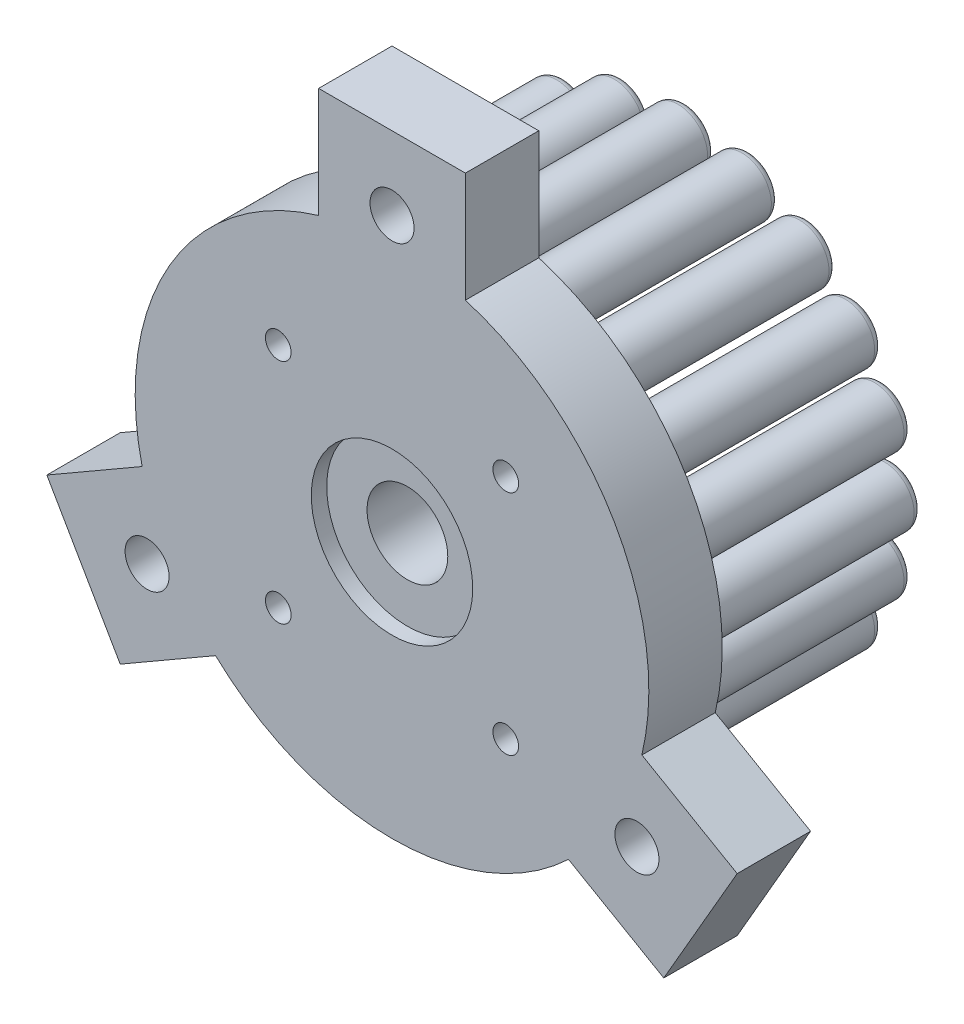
from build123d import *

# Parameters (mm, degrees)
SKIZZE1_R                          = 4
AUFSATZ_LINEAR_AUSTRAGEN1_DEPTH    = 30
AUFSATZ_LINEAR_AUSTRAGEN1_2_DEPTH  = 30
AUFSATZ_LINEAR_AUSTRAGEN1_3_DEPTH  = 30
AUFSATZ_LINEAR_AUSTRAGEN1_4_DEPTH  = 30
AUFSATZ_LINEAR_AUSTRAGEN1_5_DEPTH  = 30
AUFSATZ_LINEAR_AUSTRAGEN1_6_DEPTH  = 30
AUFSATZ_LINEAR_AUSTRAGEN1_7_DEPTH  = 30
AUFSATZ_LINEAR_AUSTRAGEN1_8_DEPTH  = 30
AUFSATZ_LINEAR_AUSTRAGEN1_9_DEPTH  = 30
AUFSATZ_LINEAR_AUSTRAGEN1_10_DEPTH = 30
AUFSATZ_LINEAR_AUSTRAGEN1_11_DEPTH = 30
AUFSATZ_LINEAR_AUSTRAGEN1_12_DEPTH = 30
AUFSATZ_LINEAR_AUSTRAGEN1_13_DEPTH = 30
AUFSATZ_LINEAR_AUSTRAGEN1_14_DEPTH = 30
AUFSATZ_LINEAR_AUSTRAGEN1_15_DEPTH = 30
AUFSATZ_LINEAR_AUSTRAGEN1_16_DEPTH = 30
AUFSATZ_LINEAR_AUSTRAGEN1_17_DEPTH = 30
AUFSATZ_LINEAR_AUSTRAGEN1_18_DEPTH = 30
AUFSATZ_LINEAR_AUSTRAGEN1_19_DEPTH = 30
AUFSATZ_LINEAR_AUSTRAGEN1_20_DEPTH = 30
SKIZZE5_R                          = 35
AUFSATZ_LINEAR_AUSTRAGEN2_DEPTH    = 10
SKIZZE6_R                          = 5.5
SCHNITT_LINEAR_AUSTRAGEN1_DEPTH    = 10
SKIZZE7_W                          = 20
SKIZZE7_H                          = 15
AUFSATZ_LINEAR_AUSTRAGEN3_DEPTH    = 10
SCHNITT_LINEAR_AUSTRAGEN3_REACH    = 80.542
SKIZZE9_R                          = 3
VERRUNDUNG2_R                      = 1
SKIZZE10_R                         = 1.75
SCHNITT_LINEAR_AUSTRAGEN4_DEPTH    = 10
SKIZZE12_R                         = 3.3
SCHNITT_LINEAR_AUSTRAGEN5_DEPTH    = 3
SKIZZE13_R                         = 11
SCHNITT_LINEAR_AUSTRAGEN6_DEPTH    = 2.1


with BuildPart() as part:
    # Skizze1 → Aufsatz-Linear austragen1 (new body)
    with BuildSketch(Plane.XY):
        with Locations((0, 28.15)):
            Circle(SKIZZE1_R)
    extrude(amount=AUFSATZ_LINEAR_AUSTRAGEN1_DEPTH)



with BuildPart() as body_2:
    # Skizze1 → Aufsatz-Linear austragen1 2 (new body)
    with BuildSketch(Plane.XY):
        with Locations((8.698828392, 26.772240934)):
            Circle(SKIZZE1_R)
    extrude(amount=AUFSATZ_LINEAR_AUSTRAGEN1_2_DEPTH)


with BuildPart() as body_3:
    # Skizze1 → Aufsatz-Linear austragen1 3 (new body)
    with BuildSketch(Plane.XY):
        with Locations((16.546154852, 22.773828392)):
            Circle(SKIZZE1_R)
    extrude(amount=AUFSATZ_LINEAR_AUSTRAGEN1_3_DEPTH)


with BuildPart() as body_4:
    # Skizze1 → Aufsatz-Linear austragen1 4 (new body)
    with BuildSketch(Plane.XY):
        with Locations((22.773828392, 16.546154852)):
            Circle(SKIZZE1_R)
    extrude(amount=AUFSATZ_LINEAR_AUSTRAGEN1_4_DEPTH)


with BuildPart() as body_5:
    # Skizze1 → Aufsatz-Linear austragen1 5 (new body)
    with BuildSketch(Plane.XY):
        with Locations((26.772240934, 8.698828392)):
            Circle(SKIZZE1_R)
    extrude(amount=AUFSATZ_LINEAR_AUSTRAGEN1_5_DEPTH)


with BuildPart() as body_6:
    # Skizze1 → Aufsatz-Linear austragen1 6 (new body)
    with BuildSketch(Plane.XY):
        with Locations((28.15, 0)):
            Circle(SKIZZE1_R)
    extrude(amount=AUFSATZ_LINEAR_AUSTRAGEN1_6_DEPTH)


with BuildPart() as body_7:
    # Skizze1 → Aufsatz-Linear austragen1 7 (new body)
    with BuildSketch(Plane.XY):
        with Locations((26.772240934, -8.698828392)):
            Circle(SKIZZE1_R)
    extrude(amount=AUFSATZ_LINEAR_AUSTRAGEN1_7_DEPTH)


with BuildPart() as body_8:
    # Skizze1 → Aufsatz-Linear austragen1 8 (new body)
    with BuildSketch(Plane.XY):
        with Locations((22.773828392, -16.546154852)):
            Circle(SKIZZE1_R)
    extrude(amount=AUFSATZ_LINEAR_AUSTRAGEN1_8_DEPTH)


with BuildPart() as body_9:
    # Skizze1 → Aufsatz-Linear austragen1 9 (new body)
    with BuildSketch(Plane.XY):
        with Locations((16.546154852, -22.773828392)):
            Circle(SKIZZE1_R)
    extrude(amount=AUFSATZ_LINEAR_AUSTRAGEN1_9_DEPTH)


with BuildPart() as body_10:
    # Skizze1 → Aufsatz-Linear austragen1 10 (new body)
    with BuildSketch(Plane.XY):
        with Locations((8.698828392, -26.772240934)):
            Circle(SKIZZE1_R)
    extrude(amount=AUFSATZ_LINEAR_AUSTRAGEN1_10_DEPTH)


with BuildPart() as body_11:
    # Skizze1 → Aufsatz-Linear austragen1 11 (new body)
    with BuildSketch(Plane.XY):
        with Locations((0, -28.15)):
            Circle(SKIZZE1_R)
    extrude(amount=AUFSATZ_LINEAR_AUSTRAGEN1_11_DEPTH)


with BuildPart() as body_12:
    # Skizze1 → Aufsatz-Linear austragen1 12 (new body)
    with BuildSketch(Plane.XY):
        with Locations((-8.698828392, -26.772240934)):
            Circle(SKIZZE1_R)
    extrude(amount=AUFSATZ_LINEAR_AUSTRAGEN1_12_DEPTH)


with BuildPart() as body_13:
    # Skizze1 → Aufsatz-Linear austragen1 13 (new body)
    with BuildSketch(Plane.XY):
        with Locations((-16.546154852, -22.773828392)):
            Circle(SKIZZE1_R)
    extrude(amount=AUFSATZ_LINEAR_AUSTRAGEN1_13_DEPTH)


with BuildPart() as body_14:
    # Skizze1 → Aufsatz-Linear austragen1 14 (new body)
    with BuildSketch(Plane.XY):
        with Locations((-22.773828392, -16.546154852)):
            Circle(SKIZZE1_R)
    extrude(amount=AUFSATZ_LINEAR_AUSTRAGEN1_14_DEPTH)


with BuildPart() as body_15:
    # Skizze1 → Aufsatz-Linear austragen1 15 (new body)
    with BuildSketch(Plane.XY):
        with Locations((-26.772240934, -8.698828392)):
            Circle(SKIZZE1_R)
    extrude(amount=AUFSATZ_LINEAR_AUSTRAGEN1_15_DEPTH)


with BuildPart() as body_16:
    # Skizze1 → Aufsatz-Linear austragen1 16 (new body)
    with BuildSketch(Plane.XY):
        with Locations((-28.15, 0)):
            Circle(SKIZZE1_R)
    extrude(amount=AUFSATZ_LINEAR_AUSTRAGEN1_16_DEPTH)


with BuildPart() as body_17:
    # Skizze1 → Aufsatz-Linear austragen1 17 (new body)
    with BuildSketch(Plane.XY):
        with Locations((-26.772240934, 8.698828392)):
            Circle(SKIZZE1_R)
    extrude(amount=AUFSATZ_LINEAR_AUSTRAGEN1_17_DEPTH)


with BuildPart() as body_18:
    # Skizze1 → Aufsatz-Linear austragen1 18 (new body)
    with BuildSketch(Plane.XY):
        with Locations((-22.773828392, 16.546154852)):
            Circle(SKIZZE1_R)
    extrude(amount=AUFSATZ_LINEAR_AUSTRAGEN1_18_DEPTH)


with BuildPart() as body_19:
    # Skizze1 → Aufsatz-Linear austragen1 19 (new body)
    with BuildSketch(Plane.XY):
        with Locations((-16.546154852, 22.773828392)):
            Circle(SKIZZE1_R)
    extrude(amount=AUFSATZ_LINEAR_AUSTRAGEN1_19_DEPTH)


with BuildPart() as body_20:
    # Skizze1 → Aufsatz-Linear austragen1 20 (new body)
    with BuildSketch(Plane.XY):
        with Locations((-8.698828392, 26.772240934)):
            Circle(SKIZZE1_R)
    extrude(amount=AUFSATZ_LINEAR_AUSTRAGEN1_20_DEPTH)


with BuildPart() as part_1:
    add(part.part)

    add(body_2.part)  # Aufsatz-Linear austragen2 merges body 2

    add(body_3.part)  # Aufsatz-Linear austragen2 merges body 3

    add(body_4.part)  # Aufsatz-Linear austragen2 merges body 4

    add(body_5.part)  # Aufsatz-Linear austragen2 merges body 5

    add(body_6.part)  # Aufsatz-Linear austragen2 merges body 6

    add(body_7.part)  # Aufsatz-Linear austragen2 merges body 7

    add(body_8.part)  # Aufsatz-Linear austragen2 merges body 8

    add(body_9.part)  # Aufsatz-Linear austragen2 merges body 9

    add(body_10.part)  # Aufsatz-Linear austragen2 merges body 10

    add(body_11.part)  # Aufsatz-Linear austragen2 merges body 11

    add(body_12.part)  # Aufsatz-Linear austragen2 merges body 12

    add(body_13.part)  # Aufsatz-Linear austragen2 merges body 13

    add(body_14.part)  # Aufsatz-Linear austragen2 merges body 14

    add(body_15.part)  # Aufsatz-Linear austragen2 merges body 15

    add(body_16.part)  # Aufsatz-Linear austragen2 merges body 16

    add(body_17.part)  # Aufsatz-Linear austragen2 merges body 17

    add(body_18.part)  # Aufsatz-Linear austragen2 merges body 18

    add(body_19.part)  # Aufsatz-Linear austragen2 merges body 19

    add(body_20.part)  # Aufsatz-Linear austragen2 merges body 20
    # Skizze5 → Aufsatz-Linear austragen2 (add)
    with BuildSketch(Plane.XY.offset(30)):
        Circle(SKIZZE5_R)
    extrude(amount=AUFSATZ_LINEAR_AUSTRAGEN2_DEPTH)

    # Skizze6 → Schnitt-Linear austragen1 (cut)
    with BuildSketch(Plane.XY.offset(40)):
        Circle(SKIZZE6_R)
    extrude(amount=-SCHNITT_LINEAR_AUSTRAGEN1_DEPTH, mode=Mode.SUBTRACT)

    # Skizze7 → Aufsatz-Linear austragen3 (add)
    with BuildSketch(Plane.XY.offset(40)):
        with Locations((0, 41.041019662)):
            Rectangle(SKIZZE7_W, SKIZZE7_H)
        Polygon((34.047375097, -8.110255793), (47.037756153, -15.610255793), (37.037756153, -32.930763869), (24.047375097, -25.430763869), align=None)
        Polygon((-24.047375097, -25.430763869), (-37.037756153, -32.930763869), (-47.037756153, -15.610255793), (-34.047375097, -8.110255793), align=None)
    extrude(amount=-AUFSATZ_LINEAR_AUSTRAGEN3_DEPTH)

    # Skizze9 → Schnitt-Linear austragen3 (cut, up to next)
    with BuildSketch(Plane.XY.offset(40), mode=Mode.PRIVATE) as schnitt_linear_austragen3_sk1:
        with Locations((0, 38.541019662)):
            Circle(SKIZZE9_R)
    schnitt_linear_austragen3_tool1 = extrude(schnitt_linear_austragen3_sk1.sketch, amount=-SCHNITT_LINEAR_AUSTRAGEN3_REACH, mode=Mode.PRIVATE) & part_1.part
    # Skizze9 → Schnitt-Linear austragen3 (cut, up to next)
    with BuildSketch(Plane.XY.offset(40), mode=Mode.PRIVATE) as schnitt_linear_austragen3_sk2:
        with Locations((33.377502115, -19.270509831)):
            Circle(SKIZZE9_R)
    schnitt_linear_austragen3_tool2 = extrude(schnitt_linear_austragen3_sk2.sketch, amount=-SCHNITT_LINEAR_AUSTRAGEN3_REACH, mode=Mode.PRIVATE) & part_1.part
    # Skizze9 → Schnitt-Linear austragen3 (cut, up to next)
    with BuildSketch(Plane.XY.offset(40), mode=Mode.PRIVATE) as schnitt_linear_austragen3_sk3:
        with Locations((-33.377502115, -19.270509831)):
            Circle(SKIZZE9_R)
    schnitt_linear_austragen3_tool3 = extrude(schnitt_linear_austragen3_sk3.sketch, amount=-SCHNITT_LINEAR_AUSTRAGEN3_REACH, mode=Mode.PRIVATE) & part_1.part
    add(schnitt_linear_austragen3_tool1.solids().sort_by_distance((0, 38.54102, 40))[0], mode=Mode.SUBTRACT)
    add(schnitt_linear_austragen3_tool2.solids().sort_by_distance((33.377502, -19.27051, 40))[0], mode=Mode.SUBTRACT)
    add(schnitt_linear_austragen3_tool3.solids().sort_by_distance((-33.377502, -19.27051, 40))[0], mode=Mode.SUBTRACT)

    # Verrundung2
    verrundung2_edges = [part_1.edges().sort_by_distance(p)[0] for p in [
        (24.15, 0, 0),
        (-26.773828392, -16.546154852, 0),
        (-30.772240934, -8.698828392, 0),
        (-32.15, 0, 0),
        (-30.772240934, 8.698828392, 0),
        (-26.773828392, 16.546154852, 0),
        (-20.546154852, 22.773828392, 0),
        (-12.698828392, 26.772240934, 0),
        (22.772240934, 8.698828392, 0),
        (18.773828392, 16.546154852, 0),
        (12.546154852, 22.773828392, 0),
        (4.698828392, 26.772240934, 0),
        (-4, 28.15, 0),
        (-20.546154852, -22.773828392, 0),
        (-12.698828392, -26.772240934, 0),
        (-4, -28.15, 0),
        (4.698828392, -26.772240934, 0),
        (12.546154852, -22.773828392, 0),
        (18.773828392, -16.546154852, 0),
        (22.772240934, -8.698828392, 0),
    ]]
    fillet(verrundung2_edges, radius=VERRUNDUNG2_R)

    # Skizze10 → Schnitt-Linear austragen4 (cut)
    with BuildSketch(Plane.XY.offset(40)):
        with Locations((-15.5, 15.5)):
            Circle(SKIZZE10_R)
        with Locations((15.5, 15.5)):
            Circle(SKIZZE10_R)
        with Locations((15.5, -15.5)):
            Circle(SKIZZE10_R)
        with Locations((-15.5, -15.5)):
            Circle(SKIZZE10_R)
    extrude(amount=-SCHNITT_LINEAR_AUSTRAGEN4_DEPTH, mode=Mode.SUBTRACT)

    # Skizze12 → Schnitt-Linear austragen5 (cut)
    with BuildSketch(Plane(origin=(0, 0, 30), x_dir=(-1, 0, 0), z_dir=(0, 0, -1))):
        with Locations((-15.5, 15.5)):
            Circle(SKIZZE12_R)
        with Locations((15.5, 15.5)):
            Circle(SKIZZE12_R)
        with Locations((-15.5, -15.5)):
            Circle(SKIZZE12_R)
        with Locations((15.5, -15.5)):
            Circle(SKIZZE12_R)
    extrude(amount=-SCHNITT_LINEAR_AUSTRAGEN5_DEPTH, mode=Mode.SUBTRACT)

    # Skizze13 → Schnitt-Linear austragen6 (cut)
    with BuildSketch(Plane.XY.offset(40)):
        Circle(SKIZZE13_R)
    extrude(amount=-SCHNITT_LINEAR_AUSTRAGEN6_DEPTH, mode=Mode.SUBTRACT)


solid = part_1.part
